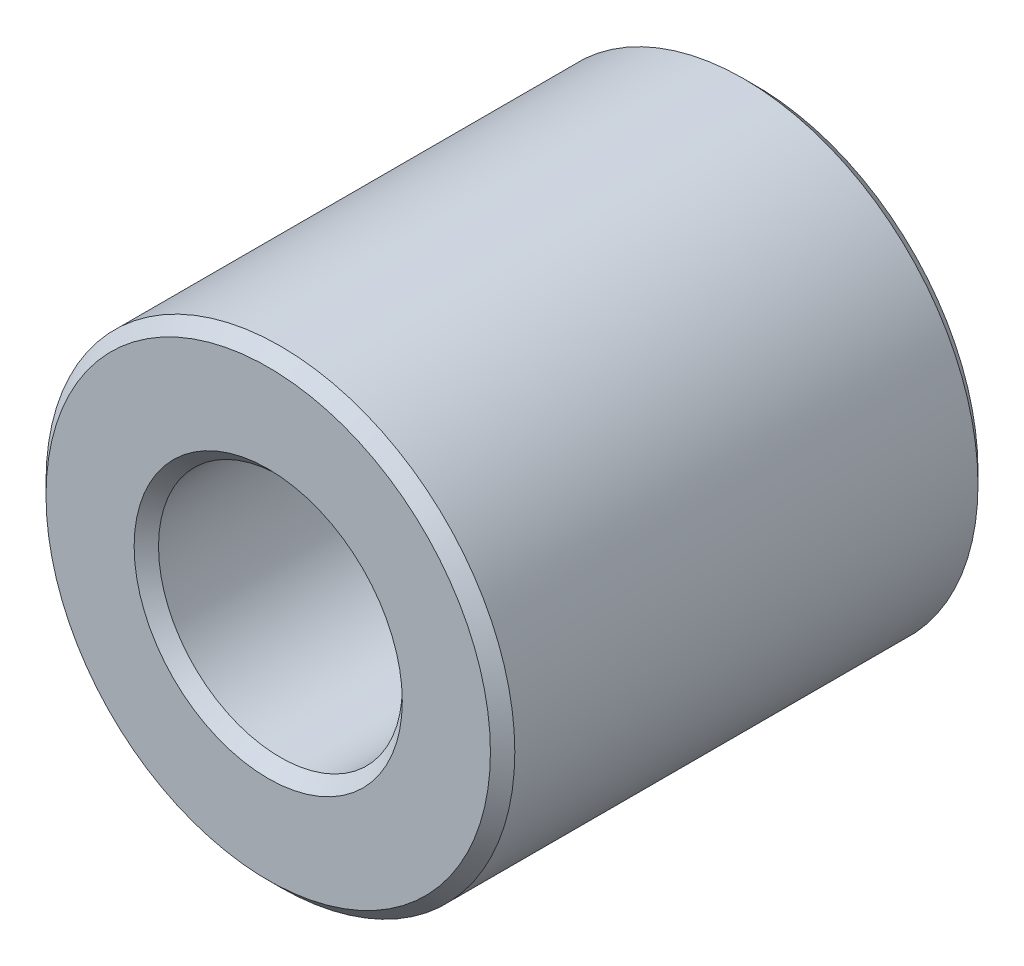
from build123d import *

# Parameters (mm, degrees)
SKETCH1_R           = 25
SKETCH1_R_2         = 13
BOSS_EXTRUDE1_DEPTH = 26
CHAMFER1_SIZE       = 1.3


with BuildPart() as part:
    # Sketch1 → Boss-Extrude1 (new, symmetric)
    with BuildSketch(Plane.XY):
        with Locations(Location((0, 0, 0), (0, 0, 180))):
            Circle(SKETCH1_R)
        with Locations(Location((0, 0, 0), (0, 0, 180))):
            Circle(SKETCH1_R_2, mode=Mode.SUBTRACT)
    extrude(amount=BOSS_EXTRUDE1_DEPTH, both=True)

    # Chamfer1
    chamfer1_edges = [part.edges().sort_by_distance(p)[0] for p in [
        (25, 0, -26),
        (25, 0, 26),
        (13, 0, -26),
        (13, 0, 26),
    ]]
    chamfer(chamfer1_edges, length=CHAMFER1_SIZE)


solid = part.part
